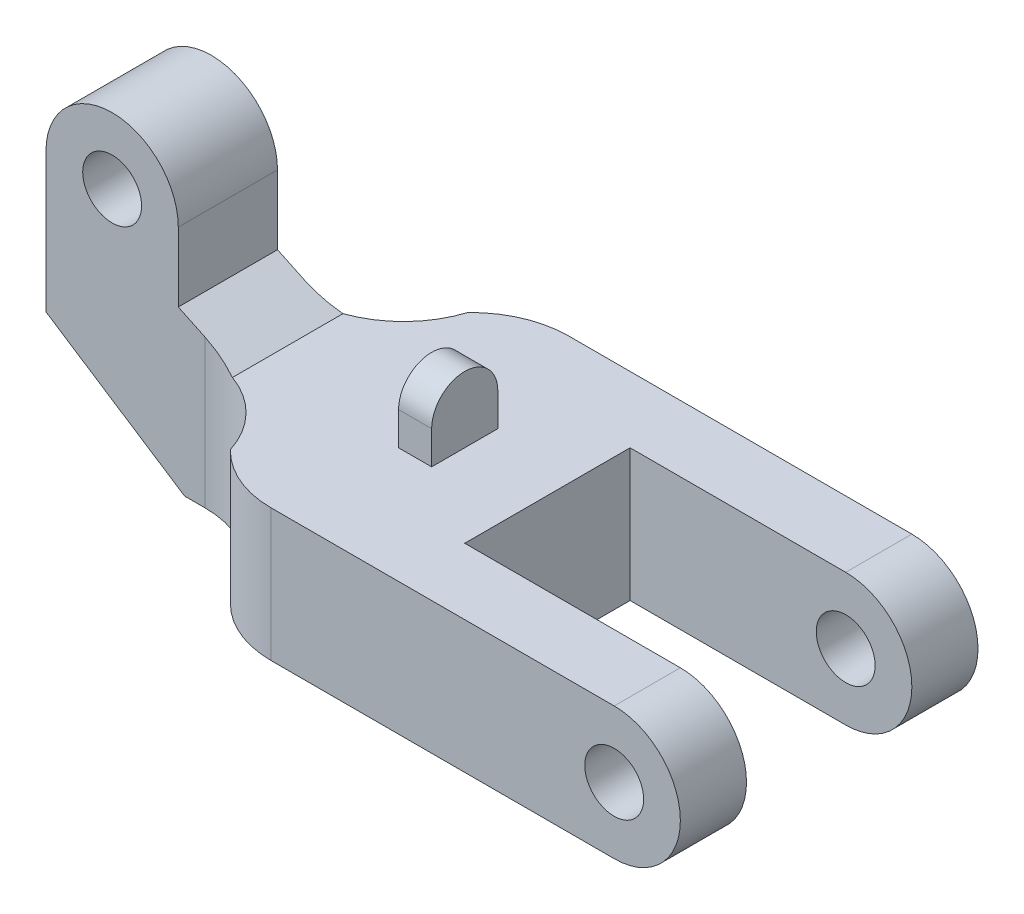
ISO-10303-21;
HEADER;
FILE_DESCRIPTION(('STEP AP214'),'2;1');
FILE_NAME('part.step','',(''),(''),'','','');
FILE_SCHEMA(('AUTOMOTIVE_DESIGN { 1 0 10303 214 1 1 1 1 }'));
ENDSEC;
DATA;
#1=APPLICATION_CONTEXT('core data for automotive mechanical design processes');
#2=APPLICATION_PROTOCOL_DEFINITION('international standard','automotive_design',2000,#1);
#3=PRODUCT_CONTEXT('',#1,'mechanical');
#4=PRODUCT('Part','Part','',(#3));
#5=PRODUCT_RELATED_PRODUCT_CATEGORY('part','',(#4));
#6=PRODUCT_DEFINITION_FORMATION('','',#4);
#7=PRODUCT_DEFINITION_CONTEXT('part definition',#1,'design');
#8=PRODUCT_DEFINITION('design','',#6,#7);
#9=PRODUCT_DEFINITION_SHAPE('','',#8);
#10=(LENGTH_UNIT() NAMED_UNIT(*) SI_UNIT(.MILLI.,.METRE.));
#11=(NAMED_UNIT(*) PLANE_ANGLE_UNIT() SI_UNIT($,.RADIAN.));
#12=(NAMED_UNIT(*) SI_UNIT($,.STERADIAN.) SOLID_ANGLE_UNIT());
#13=UNCERTAINTY_MEASURE_WITH_UNIT(LENGTH_MEASURE(1.E-05),#10,'distance_accuracy_value','');
#14=(GEOMETRIC_REPRESENTATION_CONTEXT(3) GLOBAL_UNCERTAINTY_ASSIGNED_CONTEXT((#13)) GLOBAL_UNIT_ASSIGNED_CONTEXT((#10,
#11,#12)) REPRESENTATION_CONTEXT('',''));
#15=CARTESIAN_POINT('',(0.,0.,0.));
#16=DIRECTION('',(0.,0.,1.));
#17=DIRECTION('',(1.,0.,0.));
#18=AXIS2_PLACEMENT_3D('',#15,#16,#17);
#19=CARTESIAN_POINT('',(0.,-5.72719849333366,9.));
#20=DIRECTION('',(0.,-1.,0.));
#21=DIRECTION('',(1.,0.,0.));
#22=AXIS2_PLACEMENT_3D('',#19,#20,#21);
#23=PLANE('',#22);
#24=DIRECTION('',(0.,0.,1.));
#25=VECTOR('',#24,1.);
#26=CARTESIAN_POINT('',(-26.8579530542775,-5.72719849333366,5.5));
#27=LINE('',#26,#25);
#28=CARTESIAN_POINT('',(-26.8579530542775,-5.72719849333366,3.5));
#29=VERTEX_POINT('',#28);
#30=CARTESIAN_POINT('',(-26.8579530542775,-5.72719849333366,5.5));
#31=VERTEX_POINT('',#30);
#32=EDGE_CURVE('E283',#29,#31,#27,.T.);
#33=ORIENTED_EDGE('',*,*,#32,.F.);
#34=DIRECTION('',(-1.,0.,0.));
#35=VECTOR('',#34,1.);
#36=CARTESIAN_POINT('',(-25.8579530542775,-5.72719849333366,3.5));
#37=LINE('',#36,#35);
#38=CARTESIAN_POINT('',(-25.8579530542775,-5.72719849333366,3.5));
#39=VERTEX_POINT('',#38);
#40=EDGE_CURVE('E292',#39,#29,#37,.T.);
#41=ORIENTED_EDGE('',*,*,#40,.F.);
#42=DIRECTION('',(0.,0.,-1.));
#43=VECTOR('',#42,1.);
#44=CARTESIAN_POINT('',(-25.8579530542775,-5.72719849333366,5.5));
#45=LINE('',#44,#43);
#46=CARTESIAN_POINT('',(-25.8579530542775,-5.72719849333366,5.5));
#47=VERTEX_POINT('',#46);
#48=EDGE_CURVE('E289',#47,#39,#45,.T.);
#49=ORIENTED_EDGE('',*,*,#48,.F.);
#50=DIRECTION('',(1.,0.,0.));
#51=VECTOR('',#50,1.);
#52=CARTESIAN_POINT('',(-25.8579530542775,-5.72719849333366,5.5));
#53=LINE('',#52,#51);
#54=EDGE_CURVE('E286',#31,#47,#53,.T.);
#55=ORIENTED_EDGE('',*,*,#54,.F.);
#56=EDGE_LOOP('',(#33,#41,#49,#55));
#57=FACE_BOUND('',#56,.T.);
#58=DIRECTION('',(-1.,0.,0.));
#59=VECTOR('',#58,1.);
#60=CARTESIAN_POINT('',(0.,-5.72719849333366,0.));
#61=LINE('',#60,#59);
#62=CARTESIAN_POINT('',(-16.8379530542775,-5.72719849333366,0.));
#63=VERTEX_POINT('',#62);
#64=CARTESIAN_POINT('',(-27.2112058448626,-5.72719849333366,0.));
#65=VERTEX_POINT('',#64);
#66=EDGE_CURVE('E194',#63,#65,#61,.T.);
#67=ORIENTED_EDGE('',*,*,#66,.T.);
#68=CARTESIAN_POINT('',(-27.2112058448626,-5.72719849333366,2.97638622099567));
#69=DIRECTION('',(0.,-1.,0.));
#70=DIRECTION('',(-1.,0.,0.));
#71=AXIS2_PLACEMENT_3D('',#68,#69,#70);
#72=CIRCLE('',#71,2.97638622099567);
#73=CARTESIAN_POINT('',(-29.3521440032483,-5.72719849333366,0.908716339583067));
#74=VERTEX_POINT('',#73);
#75=EDGE_CURVE('E182',#74,#65,#72,.T.);
#76=ORIENTED_EDGE('',*,*,#75,.F.);
#77=CARTESIAN_POINT('',(-32.2112058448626,-5.72719849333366,0.));
#78=DIRECTION('',(0.,-1.,0.));
#79=DIRECTION('',(1.,0.,0.));
#80=AXIS2_PLACEMENT_3D('',#77,#78,#79);
#81=CIRCLE('',#80,3.);
#82=CARTESIAN_POINT('',(-31.2112058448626,-5.72719849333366,2.82842712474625));
#83=VERTEX_POINT('',#82);
#84=EDGE_CURVE('E190',#74,#83,#81,.T.);
#85=ORIENTED_EDGE('',*,*,#84,.T.);
#86=DIRECTION('',(0.,0.,-1.));
#87=VECTOR('',#86,1.);
#88=CARTESIAN_POINT('',(-31.2112058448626,-5.72719849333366,9.));
#89=LINE('',#88,#87);
#90=CARTESIAN_POINT('',(-31.2112058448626,-5.72719849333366,6.17157287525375));
#91=VERTEX_POINT('',#90);
#92=EDGE_CURVE('E225',#91,#83,#89,.T.);
#93=ORIENTED_EDGE('',*,*,#92,.F.);
#94=CARTESIAN_POINT('',(-32.2112058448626,-5.72719849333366,9.));
#95=DIRECTION('',(0.,-1.,0.));
#96=DIRECTION('',(1.,0.,0.));
#97=AXIS2_PLACEMENT_3D('',#94,#95,#96);
#98=CIRCLE('',#97,3.);
#99=CARTESIAN_POINT('',(-29.3521440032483,-5.72719849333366,8.09128366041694));
#100=VERTEX_POINT('',#99);
#101=EDGE_CURVE('E214',#91,#100,#98,.T.);
#102=ORIENTED_EDGE('',*,*,#101,.T.);
#103=CARTESIAN_POINT('',(-27.2112058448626,-5.72719849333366,6.02361377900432));
#104=DIRECTION('',(0.,-1.,0.));
#105=DIRECTION('',(1.,0.,0.));
#106=AXIS2_PLACEMENT_3D('',#103,#104,#105);
#107=CIRCLE('',#106,2.97638622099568);
#108=CARTESIAN_POINT('',(-27.2112058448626,-5.72719849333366,9.));
#109=VERTEX_POINT('',#108);
#110=EDGE_CURVE('E57',#109,#100,#107,.T.);
#111=ORIENTED_EDGE('',*,*,#110,.F.);
#112=DIRECTION('',(-1.,0.,0.));
#113=VECTOR('',#112,1.);
#114=CARTESIAN_POINT('',(0.,-5.72719849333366,9.));
#115=LINE('',#114,#113);
#116=CARTESIAN_POINT('',(-16.8379530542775,-5.72719849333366,9.));
#117=VERTEX_POINT('',#116);
#118=EDGE_CURVE('E348',#117,#109,#115,.T.);
#119=ORIENTED_EDGE('',*,*,#118,.F.);
#120=DIRECTION('',(0.,0.,1.));
#121=VECTOR('',#120,1.);
#122=CARTESIAN_POINT('',(-16.8379530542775,-5.72719849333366,-1.));
#123=LINE('',#122,#121);
#124=CARTESIAN_POINT('',(-16.8379530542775,-5.72719849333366,7.));
#125=VERTEX_POINT('',#124);
#126=EDGE_CURVE('E307',#125,#117,#123,.T.);
#127=ORIENTED_EDGE('',*,*,#126,.F.);
#128=DIRECTION('',(1.,0.,0.));
#129=VECTOR('',#128,1.);
#130=CARTESIAN_POINT('',(-14.0579530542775,-5.72719849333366,7.));
#131=LINE('',#130,#129);
#132=CARTESIAN_POINT('',(-23.3579530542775,-5.72719849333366,7.));
#133=VERTEX_POINT('',#132);
#134=EDGE_CURVE('E321',#133,#125,#131,.T.);
#135=ORIENTED_EDGE('',*,*,#134,.F.);
#136=DIRECTION('',(0.,0.,1.));
#137=VECTOR('',#136,1.);
#138=CARTESIAN_POINT('',(-23.3579530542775,-5.72719849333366,2.));
#139=LINE('',#138,#137);
#140=CARTESIAN_POINT('',(-23.3579530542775,-5.72719849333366,2.));
#141=VERTEX_POINT('',#140);
#142=EDGE_CURVE('E319',#141,#133,#139,.T.);
#143=ORIENTED_EDGE('',*,*,#142,.F.);
#144=DIRECTION('',(-1.,0.,0.));
#145=VECTOR('',#144,1.);
#146=CARTESIAN_POINT('',(-14.0579530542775,-5.72719849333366,2.));
#147=LINE('',#146,#145);
#148=CARTESIAN_POINT('',(-16.8379530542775,-5.72719849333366,2.));
#149=VERTEX_POINT('',#148);
#150=EDGE_CURVE('E324',#149,#141,#147,.T.);
#151=ORIENTED_EDGE('',*,*,#150,.F.);
#152=EDGE_CURVE('E309',#63,#149,#123,.T.);
#153=ORIENTED_EDGE('',*,*,#152,.F.);
#154=EDGE_LOOP('',(#67,#76,#85,#93,#102,#111,#119,#127,#135,#143,#151,#153));
#155=FACE_BOUND('',#154,.T.);
#156=ADVANCED_FACE('F35',(#57,#155),#23,.F.);
#157=CARTESIAN_POINT('',(0.,-9.72719849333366,9.));
#158=DIRECTION('',(0.,1.,0.));
#159=DIRECTION('',(0.,0.,1.));
#160=AXIS2_PLACEMENT_3D('',#157,#158,#159);
#161=PLANE('',#160);
#162=CARTESIAN_POINT('',(-32.2112058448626,-9.72719849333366,0.));
#163=DIRECTION('',(0.,1.,0.));
#164=DIRECTION('',(0.,0.,1.));
#165=AXIS2_PLACEMENT_3D('',#162,#163,#164);
#166=CIRCLE('',#165,3.);
#167=CARTESIAN_POINT('',(-32.2112058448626,-9.72719849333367,3.));
#168=VERTEX_POINT('',#167);
#169=CARTESIAN_POINT('',(-29.3521440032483,-9.72719849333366,0.908716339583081));
#170=VERTEX_POINT('',#169);
#171=EDGE_CURVE('E203',#168,#170,#166,.T.);
#172=ORIENTED_EDGE('',*,*,#171,.T.);
#173=CARTESIAN_POINT('',(-27.2112058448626,-9.72719849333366,2.97638622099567));
#174=DIRECTION('',(0.,1.,0.));
#175=DIRECTION('',(0.,0.,1.));
#176=AXIS2_PLACEMENT_3D('',#173,#174,#175);
#177=CIRCLE('',#176,2.97638622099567);
#178=CARTESIAN_POINT('',(-27.2112058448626,-9.72719849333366,0.));
#179=VERTEX_POINT('',#178);
#180=EDGE_CURVE('E50',#170,#179,#177,.F.);
#181=ORIENTED_EDGE('',*,*,#180,.T.);
#182=DIRECTION('',(1.,0.,0.));
#183=VECTOR('',#182,1.);
#184=CARTESIAN_POINT('',(0.,-9.72719849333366,0.));
#185=LINE('',#184,#183);
#186=CARTESIAN_POINT('',(-16.8379530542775,-9.72719849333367,0.));
#187=VERTEX_POINT('',#186);
#188=EDGE_CURVE('E352',#179,#187,#185,.T.);
#189=ORIENTED_EDGE('',*,*,#188,.T.);
#190=DIRECTION('',(0.,0.,1.));
#191=VECTOR('',#190,1.);
#192=CARTESIAN_POINT('',(-16.8379530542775,-9.72719849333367,-1.));
#193=LINE('',#192,#191);
#194=CARTESIAN_POINT('',(-16.8379530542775,-9.72719849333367,2.));
#195=VERTEX_POINT('',#194);
#196=EDGE_CURVE('E310',#187,#195,#193,.T.);
#197=ORIENTED_EDGE('',*,*,#196,.T.);
#198=DIRECTION('',(-1.,0.,0.));
#199=VECTOR('',#198,1.);
#200=CARTESIAN_POINT('',(0.,-9.72719849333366,1.99999999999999));
#201=LINE('',#200,#199);
#202=CARTESIAN_POINT('',(-23.3579530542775,-9.72719849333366,2.));
#203=VERTEX_POINT('',#202);
#204=EDGE_CURVE('E337',#195,#203,#201,.T.);
#205=ORIENTED_EDGE('',*,*,#204,.T.);
#206=DIRECTION('',(0.,0.,1.));
#207=VECTOR('',#206,1.);
#208=CARTESIAN_POINT('',(-23.3579530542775,-9.72719849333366,9.));
#209=LINE('',#208,#207);
#210=CARTESIAN_POINT('',(-23.3579530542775,-9.72719849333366,7.));
#211=VERTEX_POINT('',#210);
#212=EDGE_CURVE('E339',#203,#211,#209,.T.);
#213=ORIENTED_EDGE('',*,*,#212,.T.);
#214=DIRECTION('',(1.,0.,0.));
#215=VECTOR('',#214,1.);
#216=CARTESIAN_POINT('',(0.,-9.72719849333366,7.));
#217=LINE('',#216,#215);
#218=CARTESIAN_POINT('',(-16.8379530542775,-9.72719849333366,7.));
#219=VERTEX_POINT('',#218);
#220=EDGE_CURVE('E333',#211,#219,#217,.T.);
#221=ORIENTED_EDGE('',*,*,#220,.T.);
#222=CARTESIAN_POINT('',(-16.8379530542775,-9.72719849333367,9.));
#223=VERTEX_POINT('',#222);
#224=EDGE_CURVE('E306',#219,#223,#193,.T.);
#225=ORIENTED_EDGE('',*,*,#224,.T.);
#226=DIRECTION('',(1.,0.,0.));
#227=VECTOR('',#226,1.);
#228=CARTESIAN_POINT('',(0.,-9.72719849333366,9.));
#229=LINE('',#228,#227);
#230=CARTESIAN_POINT('',(-27.2112058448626,-9.72719849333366,9.));
#231=VERTEX_POINT('',#230);
#232=EDGE_CURVE('E346',#231,#223,#229,.T.);
#233=ORIENTED_EDGE('',*,*,#232,.F.);
#234=CARTESIAN_POINT('',(-27.2112058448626,-9.72719849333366,6.02361377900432));
#235=DIRECTION('',(0.,1.,0.));
#236=DIRECTION('',(0.,0.,1.));
#237=AXIS2_PLACEMENT_3D('',#234,#235,#236);
#238=CIRCLE('',#237,2.97638622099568);
#239=CARTESIAN_POINT('',(-29.3521440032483,-9.72719849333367,8.09128366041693));
#240=VERTEX_POINT('',#239);
#241=EDGE_CURVE('E395',#231,#240,#238,.F.);
#242=ORIENTED_EDGE('',*,*,#241,.T.);
#243=CARTESIAN_POINT('',(-32.2112058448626,-9.72719849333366,9.));
#244=DIRECTION('',(0.,1.,0.));
#245=DIRECTION('',(0.,0.,1.));
#246=AXIS2_PLACEMENT_3D('',#243,#244,#245);
#247=CIRCLE('',#246,3.);
#248=CARTESIAN_POINT('',(-32.2112058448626,-9.72719849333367,6.));
#249=VERTEX_POINT('',#248);
#250=EDGE_CURVE('E217',#240,#249,#247,.T.);
#251=ORIENTED_EDGE('',*,*,#250,.T.);
#252=DIRECTION('',(1.,0.,0.));
#253=VECTOR('',#252,1.);
#254=CARTESIAN_POINT('',(-32.8279530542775,-9.72719849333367,6.));
#255=LINE('',#254,#253);
#256=CARTESIAN_POINT('',(-32.8279530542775,-9.72719849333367,6.));
#257=VERTEX_POINT('',#256);
#258=EDGE_CURVE('E239',#257,#249,#255,.T.);
#259=ORIENTED_EDGE('',*,*,#258,.F.);
#260=DIRECTION('',(0.,0.,-1.));
#261=VECTOR('',#260,1.);
#262=CARTESIAN_POINT('',(-32.8279530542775,-9.72719849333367,9.));
#263=LINE('',#262,#261);
#264=CARTESIAN_POINT('',(-32.8279530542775,-9.72719849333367,3.));
#265=VERTEX_POINT('',#264);
#266=EDGE_CURVE('E227',#257,#265,#263,.T.);
#267=ORIENTED_EDGE('',*,*,#266,.T.);
#268=DIRECTION('',(-1.,0.,0.));
#269=VECTOR('',#268,1.);
#270=CARTESIAN_POINT('',(-32.8279530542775,-9.72719849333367,3.));
#271=LINE('',#270,#269);
#272=EDGE_CURVE('E256',#168,#265,#271,.T.);
#273=ORIENTED_EDGE('',*,*,#272,.F.);
#274=EDGE_LOOP('',(#172,#181,#189,#197,#205,#213,#221,#225,#233,#242,#251,#259,#267,#273));
#275=FACE_BOUND('',#274,.T.);
#276=ADVANCED_FACE('F373',(#275),#161,.F.);
#277=CARTESIAN_POINT('',(0.,0.,0.));
#278=DIRECTION('',(0.,0.,1.));
#279=DIRECTION('',(1.,0.,0.));
#280=AXIS2_PLACEMENT_3D('',#277,#278,#279);
#281=PLANE('',#280);
#282=CARTESIAN_POINT('',(-16.8379530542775,-7.72719849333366,0.));
#283=DIRECTION('',(0.,0.,1.));
#284=DIRECTION('',(1.,0.,0.));
#285=AXIS2_PLACEMENT_3D('',#282,#283,#284);
#286=CIRCLE('',#285,0.89);
#287=CARTESIAN_POINT('',(-15.9479530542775,-7.72719849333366,0.));
#288=VERTEX_POINT('',#287);
#289=EDGE_CURVE('E342',#288,#288,#286,.T.);
#290=ORIENTED_EDGE('',*,*,#289,.T.);
#291=EDGE_LOOP('',(#290));
#292=FACE_BOUND('',#291,.T.);
#293=DIRECTION('',(0.,1.,0.));
#294=VECTOR('',#293,1.);
#295=CARTESIAN_POINT('',(-27.2112058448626,-10.7271984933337,0.));
#296=LINE('',#295,#294);
#297=EDGE_CURVE('E195',#179,#65,#296,.T.);
#298=ORIENTED_EDGE('',*,*,#297,.T.);
#299=ORIENTED_EDGE('',*,*,#66,.F.);
#300=CARTESIAN_POINT('',(-16.8379530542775,-7.72719849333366,0.));
#301=DIRECTION('',(0.,0.,1.));
#302=DIRECTION('',(1.,0.,0.));
#303=AXIS2_PLACEMENT_3D('',#300,#301,#302);
#304=CIRCLE('',#303,2.);
#305=EDGE_CURVE('E316',#63,#187,#304,.F.);
#306=ORIENTED_EDGE('',*,*,#305,.T.);
#307=ORIENTED_EDGE('',*,*,#188,.F.);
#308=EDGE_LOOP('',(#298,#299,#306,#307));
#309=FACE_BOUND('',#308,.T.);
#310=ADVANCED_FACE('F405',(#292,#309),#281,.F.);
#311=CARTESIAN_POINT('',(0.,0.,9.));
#312=DIRECTION('',(0.,0.,1.));
#313=DIRECTION('',(1.,0.,0.));
#314=AXIS2_PLACEMENT_3D('',#311,#312,#313);
#315=PLANE('',#314);
#316=CARTESIAN_POINT('',(-16.8379530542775,-7.72719849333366,9.));
#317=DIRECTION('',(0.,0.,1.));
#318=DIRECTION('',(1.,0.,0.));
#319=AXIS2_PLACEMENT_3D('',#316,#317,#318);
#320=CIRCLE('',#319,0.89);
#321=CARTESIAN_POINT('',(-15.9479530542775,-7.72719849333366,9.));
#322=VERTEX_POINT('',#321);
#323=EDGE_CURVE('E343',#322,#322,#320,.T.);
#324=ORIENTED_EDGE('',*,*,#323,.F.);
#325=EDGE_LOOP('',(#324));
#326=FACE_BOUND('',#325,.T.);
#327=ORIENTED_EDGE('',*,*,#118,.T.);
#328=DIRECTION('',(0.,1.,0.));
#329=VECTOR('',#328,1.);
#330=CARTESIAN_POINT('',(-27.2112058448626,-10.7271984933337,9.));
#331=LINE('',#330,#329);
#332=EDGE_CURVE('E399',#231,#109,#331,.T.);
#333=ORIENTED_EDGE('',*,*,#332,.F.);
#334=ORIENTED_EDGE('',*,*,#232,.T.);
#335=CARTESIAN_POINT('',(-16.8379530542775,-7.72719849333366,9.));
#336=DIRECTION('',(0.,0.,-1.));
#337=DIRECTION('',(1.,0.,0.));
#338=AXIS2_PLACEMENT_3D('',#335,#336,#337);
#339=CIRCLE('',#338,2.);
#340=EDGE_CURVE('E303',#117,#223,#339,.T.);
#341=ORIENTED_EDGE('',*,*,#340,.F.);
#342=EDGE_LOOP('',(#327,#333,#334,#341));
#343=FACE_BOUND('',#342,.T.);
#344=ADVANCED_FACE('F429',(#326,#343),#315,.T.);
#345=CARTESIAN_POINT('',(-33.018703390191,0.,9.));
#346=DIRECTION('',(1.,0.,0.));
#347=DIRECTION('',(0.,0.,-1.));
#348=AXIS2_PLACEMENT_3D('',#345,#346,#347);
#349=PLANE('',#348);
#350=DIRECTION('',(0.,0.,-1.));
#351=VECTOR('',#350,1.);
#352=CARTESIAN_POINT('',(-33.018703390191,-2.78,9.));
#353=LINE('',#352,#351);
#354=CARTESIAN_POINT('',(-33.018703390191,-2.78,6.));
#355=VERTEX_POINT('',#354);
#356=CARTESIAN_POINT('',(-33.018703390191,-2.78,3.));
#357=VERTEX_POINT('',#356);
#358=EDGE_CURVE('E361',#355,#357,#353,.T.);
#359=ORIENTED_EDGE('',*,*,#358,.F.);
#360=DIRECTION('',(0.,1.,0.));
#361=VECTOR('',#360,1.);
#362=CARTESIAN_POINT('',(-33.018703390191,-4.87107197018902,6.));
#363=LINE('',#362,#361);
#364=CARTESIAN_POINT('',(-33.018703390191,-4.87107197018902,6.));
#365=VERTEX_POINT('',#364);
#366=EDGE_CURVE('E392',#365,#355,#363,.T.);
#367=ORIENTED_EDGE('',*,*,#366,.F.);
#368=DIRECTION('',(0.,0.,-1.));
#369=VECTOR('',#368,1.);
#370=CARTESIAN_POINT('',(-33.018703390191,-4.87107197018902,9.));
#371=LINE('',#370,#369);
#372=CARTESIAN_POINT('',(-33.018703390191,-4.87107197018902,3.));
#373=VERTEX_POINT('',#372);
#374=EDGE_CURVE('E228',#365,#373,#371,.T.);
#375=ORIENTED_EDGE('',*,*,#374,.T.);
#376=DIRECTION('',(0.,-1.,0.));
#377=VECTOR('',#376,1.);
#378=CARTESIAN_POINT('',(-33.018703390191,-4.87107197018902,3.));
#379=LINE('',#378,#377);
#380=EDGE_CURVE('E267',#357,#373,#379,.T.);
#381=ORIENTED_EDGE('',*,*,#380,.F.);
#382=EDGE_LOOP('',(#359,#367,#375,#381));
#383=FACE_BOUND('',#382,.T.);
#384=ADVANCED_FACE('F391',(#383),#349,.T.);
#385=CARTESIAN_POINT('',(-35.018703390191,-2.78,9.));
#386=DIRECTION('',(0.,0.,-1.));
#387=DIRECTION('',(-1.,0.,0.));
#388=AXIS2_PLACEMENT_3D('',#385,#386,#387);
#389=CYLINDRICAL_SURFACE('',#388,2.);
#390=CARTESIAN_POINT('',(-35.018703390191,-2.78,6.));
#391=DIRECTION('',(0.,0.,1.));
#392=DIRECTION('',(1.,0.,0.));
#393=AXIS2_PLACEMENT_3D('',#390,#391,#392);
#394=CIRCLE('',#393,2.);
#395=CARTESIAN_POINT('',(-37.018703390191,-2.78,6.));
#396=VERTEX_POINT('',#395);
#397=EDGE_CURVE('E387',#355,#396,#394,.T.);
#398=ORIENTED_EDGE('',*,*,#397,.F.);
#399=ORIENTED_EDGE('',*,*,#358,.T.);
#400=CARTESIAN_POINT('',(-35.018703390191,-2.78,3.));
#401=DIRECTION('',(0.,0.,-1.));
#402=DIRECTION('',(1.,0.,0.));
#403=AXIS2_PLACEMENT_3D('',#400,#401,#402);
#404=CIRCLE('',#403,2.);
#405=CARTESIAN_POINT('',(-37.018703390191,-2.78,3.));
#406=VERTEX_POINT('',#405);
#407=EDGE_CURVE('E264',#406,#357,#404,.T.);
#408=ORIENTED_EDGE('',*,*,#407,.F.);
#409=DIRECTION('',(0.,0.,-1.));
#410=VECTOR('',#409,1.);
#411=CARTESIAN_POINT('',(-37.018703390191,-2.78,9.));
#412=LINE('',#411,#410);
#413=EDGE_CURVE('E359',#396,#406,#412,.T.);
#414=ORIENTED_EDGE('',*,*,#413,.F.);
#415=EDGE_LOOP('',(#398,#399,#408,#414));
#416=FACE_BOUND('',#415,.T.);
#417=ADVANCED_FACE('F386',(#416),#389,.T.);
#418=CARTESIAN_POINT('',(-37.018703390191,0.,9.));
#419=DIRECTION('',(1.,0.,0.));
#420=DIRECTION('',(0.,0.,-1.));
#421=AXIS2_PLACEMENT_3D('',#418,#419,#420);
#422=PLANE('',#421);
#423=DIRECTION('',(0.,-1.,0.));
#424=VECTOR('',#423,1.);
#425=CARTESIAN_POINT('',(-37.018703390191,-2.78,6.));
#426=LINE('',#425,#424);
#427=CARTESIAN_POINT('',(-37.018703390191,-7.,6.));
#428=VERTEX_POINT('',#427);
#429=EDGE_CURVE('E250',#396,#428,#426,.T.);
#430=ORIENTED_EDGE('',*,*,#429,.F.);
#431=ORIENTED_EDGE('',*,*,#413,.T.);
#432=DIRECTION('',(0.,1.,0.));
#433=VECTOR('',#432,1.);
#434=CARTESIAN_POINT('',(-37.018703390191,-2.78,3.));
#435=LINE('',#434,#433);
#436=CARTESIAN_POINT('',(-37.018703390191,-7.,3.));
#437=VERTEX_POINT('',#436);
#438=EDGE_CURVE('E261',#437,#406,#435,.T.);
#439=ORIENTED_EDGE('',*,*,#438,.F.);
#440=DIRECTION('',(0.,0.,-1.));
#441=VECTOR('',#440,1.);
#442=CARTESIAN_POINT('',(-37.018703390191,-7.,9.));
#443=LINE('',#442,#441);
#444=EDGE_CURVE('E357',#428,#437,#443,.T.);
#445=ORIENTED_EDGE('',*,*,#444,.F.);
#446=EDGE_LOOP('',(#430,#431,#439,#445));
#447=FACE_BOUND('',#446,.T.);
#448=ADVANCED_FACE('F382',(#447),#422,.F.);
#449=CARTESIAN_POINT('',(-14.2133517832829,-21.8409510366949,9.));
#450=DIRECTION('',(0.545439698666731,0.838150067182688,0.));
#451=DIRECTION('',(-0.838150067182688,0.545439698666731,0.));
#452=AXIS2_PLACEMENT_3D('',#449,#450,#451);
#453=PLANE('',#452);
#454=DIRECTION('',(0.838150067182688,-0.545439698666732,0.));
#455=VECTOR('',#454,1.);
#456=CARTESIAN_POINT('',(-37.018703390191,-7.,6.));
#457=LINE('',#456,#455);
#458=EDGE_CURVE('E241',#428,#257,#457,.T.);
#459=ORIENTED_EDGE('',*,*,#458,.F.);
#460=ORIENTED_EDGE('',*,*,#444,.T.);
#461=DIRECTION('',(-0.838150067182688,0.545439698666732,0.));
#462=VECTOR('',#461,1.);
#463=CARTESIAN_POINT('',(-37.018703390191,-7.,3.));
#464=LINE('',#463,#462);
#465=EDGE_CURVE('E258',#265,#437,#464,.T.);
#466=ORIENTED_EDGE('',*,*,#465,.F.);
#467=ORIENTED_EDGE('',*,*,#266,.F.);
#468=EDGE_LOOP('',(#459,#460,#466,#467));
#469=FACE_BOUND('',#468,.T.);
#470=ADVANCED_FACE('F376',(#469),#453,.F.);
#471=CARTESIAN_POINT('',(-35.018703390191,-2.78,9.));
#472=DIRECTION('',(0.,0.,-1.));
#473=DIRECTION('',(-1.,0.,0.));
#474=AXIS2_PLACEMENT_3D('',#471,#472,#473);
#475=CYLINDRICAL_SURFACE('',#474,0.89);
#476=CARTESIAN_POINT('',(-35.018703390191,-2.78,3.));
#477=DIRECTION('',(0.,0.,-1.));
#478=DIRECTION('',(-1.,0.,0.));
#479=AXIS2_PLACEMENT_3D('',#476,#477,#478);
#480=CIRCLE('',#479,0.89);
#481=CARTESIAN_POINT('',(-35.908703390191,-2.78,3.));
#482=VERTEX_POINT('',#481);
#483=EDGE_CURVE('E248',#482,#482,#480,.T.);
#484=ORIENTED_EDGE('',*,*,#483,.T.);
#485=EDGE_LOOP('',(#484));
#486=FACE_BOUND('',#485,.T.);
#487=CARTESIAN_POINT('',(-35.018703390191,-2.78,6.));
#488=DIRECTION('',(0.,0.,1.));
#489=DIRECTION('',(1.,0.,0.));
#490=AXIS2_PLACEMENT_3D('',#487,#488,#489);
#491=CIRCLE('',#490,0.89);
#492=CARTESIAN_POINT('',(-34.128703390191,-2.78,6.));
#493=VERTEX_POINT('',#492);
#494=EDGE_CURVE('E245',#493,#493,#491,.T.);
#495=ORIENTED_EDGE('',*,*,#494,.T.);
#496=EDGE_LOOP('',(#495));
#497=FACE_BOUND('',#496,.T.);
#498=ADVANCED_FACE('F453',(#486,#497),#475,.F.);
#499=CARTESIAN_POINT('',(-7.93471724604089,-16.7521757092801,9.));
#500=DIRECTION('',(0.428063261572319,0.903748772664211,0.));
#501=DIRECTION('',(-0.903748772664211,0.428063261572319,0.));
#502=AXIS2_PLACEMENT_3D('',#499,#500,#501);
#503=PLANE('',#502);
#504=ORIENTED_EDGE('',*,*,#374,.F.);
#505=DIRECTION('',(-0.903748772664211,0.428063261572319,0.));
#506=VECTOR('',#505,1.);
#507=CARTESIAN_POINT('',(-31.2112058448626,-5.72719849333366,6.));
#508=LINE('',#507,#506);
#509=CARTESIAN_POINT('',(-32.2112058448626,-5.25354555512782,6.));
#510=VERTEX_POINT('',#509);
#511=EDGE_CURVE('E233',#510,#365,#508,.T.);
#512=ORIENTED_EDGE('',*,*,#511,.F.);
#513=CARTESIAN_POINT('',(-32.2112058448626,-5.25354555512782,9.));
#514=DIRECTION('',(0.428063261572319,0.903748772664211,0.));
#515=DIRECTION('',(-0.903748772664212,0.428063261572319,0.));
#516=AXIS2_PLACEMENT_3D('',#513,#514,#515);
#517=ELLIPSE('',#516,3.31950658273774,3.);
#518=EDGE_CURVE('E211',#510,#91,#517,.F.);
#519=ORIENTED_EDGE('',*,*,#518,.T.);
#520=ORIENTED_EDGE('',*,*,#92,.T.);
#521=CARTESIAN_POINT('',(-32.2112058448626,-5.25354555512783,0.));
#522=DIRECTION('',(0.428063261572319,0.903748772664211,0.));
#523=DIRECTION('',(0.903748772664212,-0.428063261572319,0.));
#524=AXIS2_PLACEMENT_3D('',#521,#522,#523);
#525=ELLIPSE('',#524,3.31950658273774,3.);
#526=CARTESIAN_POINT('',(-32.2112058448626,-5.25354555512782,3.));
#527=VERTEX_POINT('',#526);
#528=EDGE_CURVE('E200',#83,#527,#525,.F.);
#529=ORIENTED_EDGE('',*,*,#528,.T.);
#530=DIRECTION('',(0.903748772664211,-0.428063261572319,0.));
#531=VECTOR('',#530,1.);
#532=CARTESIAN_POINT('',(-31.2112058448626,-5.72719849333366,3.));
#533=LINE('',#532,#531);
#534=EDGE_CURVE('E270',#373,#527,#533,.T.);
#535=ORIENTED_EDGE('',*,*,#534,.F.);
#536=EDGE_LOOP('',(#504,#512,#519,#520,#529,#535));
#537=FACE_BOUND('',#536,.T.);
#538=ADVANCED_FACE('F232',(#537),#503,.T.);
#539=CARTESIAN_POINT('',(-26.8579530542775,-3.72719849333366,5.5));
#540=DIRECTION('',(1.,0.,0.));
#541=DIRECTION('',(0.,1.,0.));
#542=AXIS2_PLACEMENT_3D('',#539,#540,#541);
#543=PLANE('',#542);
#544=CARTESIAN_POINT('',(-26.8579530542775,-4.72719849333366,4.5));
#545=DIRECTION('',(1.,0.,0.));
#546=DIRECTION('',(0.,1.,0.));
#547=AXIS2_PLACEMENT_3D('',#544,#545,#546);
#548=CIRCLE('',#547,1.);
#549=CARTESIAN_POINT('',(-26.8579530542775,-4.72719849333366,3.5));
#550=VERTEX_POINT('',#549);
#551=CARTESIAN_POINT('',(-26.8579530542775,-4.72719849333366,5.5));
#552=VERTEX_POINT('',#551);
#553=EDGE_CURVE('E280',#550,#552,#548,.T.);
#554=ORIENTED_EDGE('',*,*,#553,.F.);
#555=DIRECTION('',(0.,-1.,0.));
#556=VECTOR('',#555,1.);
#557=CARTESIAN_POINT('',(-26.8579530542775,-3.72719849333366,3.5));
#558=LINE('',#557,#556);
#559=EDGE_CURVE('E295',#550,#29,#558,.T.);
#560=ORIENTED_EDGE('',*,*,#559,.T.);
#561=ORIENTED_EDGE('',*,*,#32,.T.);
#562=DIRECTION('',(0.,-1.,0.));
#563=VECTOR('',#562,1.);
#564=CARTESIAN_POINT('',(-26.8579530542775,-3.72719849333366,5.5));
#565=LINE('',#564,#563);
#566=EDGE_CURVE('E301',#552,#31,#565,.T.);
#567=ORIENTED_EDGE('',*,*,#566,.F.);
#568=EDGE_LOOP('',(#554,#560,#561,#567));
#569=FACE_BOUND('',#568,.T.);
#570=ADVANCED_FACE('F491',(#569),#543,.F.);
#571=CARTESIAN_POINT('',(-25.8579530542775,-3.72719849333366,5.5));
#572=DIRECTION('',(-1.,0.,0.));
#573=DIRECTION('',(0.,-1.,0.));
#574=AXIS2_PLACEMENT_3D('',#571,#572,#573);
#575=PLANE('',#574);
#576=CARTESIAN_POINT('',(-25.8579530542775,-4.72719849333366,4.5));
#577=DIRECTION('',(-1.,0.,0.));
#578=DIRECTION('',(0.,-1.,0.));
#579=AXIS2_PLACEMENT_3D('',#576,#577,#578);
#580=CIRCLE('',#579,1.);
#581=CARTESIAN_POINT('',(-25.8579530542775,-4.72719849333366,3.5));
#582=VERTEX_POINT('',#581);
#583=CARTESIAN_POINT('',(-25.8579530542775,-4.72719849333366,5.5));
#584=VERTEX_POINT('',#583);
#585=EDGE_CURVE('E273',#582,#584,#580,.F.);
#586=ORIENTED_EDGE('',*,*,#585,.T.);
#587=DIRECTION('',(0.,-1.,0.));
#588=VECTOR('',#587,1.);
#589=CARTESIAN_POINT('',(-25.8579530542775,-3.72719849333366,5.5));
#590=LINE('',#589,#588);
#591=EDGE_CURVE('E299',#584,#47,#590,.T.);
#592=ORIENTED_EDGE('',*,*,#591,.T.);
#593=ORIENTED_EDGE('',*,*,#48,.T.);
#594=DIRECTION('',(0.,-1.,0.));
#595=VECTOR('',#594,1.);
#596=CARTESIAN_POINT('',(-25.8579530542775,-3.72719849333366,3.5));
#597=LINE('',#596,#595);
#598=EDGE_CURVE('E297',#582,#39,#597,.T.);
#599=ORIENTED_EDGE('',*,*,#598,.F.);
#600=EDGE_LOOP('',(#586,#592,#593,#599));
#601=FACE_BOUND('',#600,.T.);
#602=ADVANCED_FACE('F487',(#601),#575,.F.);
#603=CARTESIAN_POINT('',(-25.8579530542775,-3.72719849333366,3.5));
#604=DIRECTION('',(0.,0.,1.));
#605=DIRECTION('',(1.,0.,0.));
#606=AXIS2_PLACEMENT_3D('',#603,#604,#605);
#607=PLANE('',#606);
#608=DIRECTION('',(-1.,0.,0.));
#609=VECTOR('',#608,1.);
#610=CARTESIAN_POINT('',(17.3603083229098,-4.72719849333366,3.5));
#611=LINE('',#610,#609);
#612=EDGE_CURVE('E275',#582,#550,#611,.T.);
#613=ORIENTED_EDGE('',*,*,#612,.F.);
#614=ORIENTED_EDGE('',*,*,#598,.T.);
#615=ORIENTED_EDGE('',*,*,#40,.T.);
#616=ORIENTED_EDGE('',*,*,#559,.F.);
#617=EDGE_LOOP('',(#613,#614,#615,#616));
#618=FACE_BOUND('',#617,.T.);
#619=ADVANCED_FACE('F484',(#618),#607,.F.);
#620=CARTESIAN_POINT('',(-16.8379530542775,-7.72719849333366,9.));
#621=DIRECTION('',(0.,0.,-1.));
#622=DIRECTION('',(-1.,0.,0.));
#623=AXIS2_PLACEMENT_3D('',#620,#621,#622);
#624=CYLINDRICAL_SURFACE('',#623,0.89);
#625=CARTESIAN_POINT('',(-16.8379530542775,-7.72719849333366,2.));
#626=DIRECTION('',(0.,0.,-1.));
#627=DIRECTION('',(-1.,0.,0.));
#628=AXIS2_PLACEMENT_3D('',#625,#626,#627);
#629=CIRCLE('',#628,0.89);
#630=CARTESIAN_POINT('',(-17.7279530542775,-7.72719849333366,2.));
#631=VERTEX_POINT('',#630);
#632=EDGE_CURVE('E336',#631,#631,#629,.T.);
#633=ORIENTED_EDGE('',*,*,#632,.F.);
#634=EDGE_LOOP('',(#633));
#635=FACE_BOUND('',#634,.T.);
#636=ORIENTED_EDGE('',*,*,#289,.F.);
#637=EDGE_LOOP('',(#636));
#638=FACE_BOUND('',#637,.T.);
#639=ADVANCED_FACE('F463',(#635,#638),#624,.F.);
#640=CARTESIAN_POINT('',(-16.8379530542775,-7.72719849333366,7.));
#641=DIRECTION('',(0.,0.,1.));
#642=DIRECTION('',(1.,0.,0.));
#643=AXIS2_PLACEMENT_3D('',#640,#641,#642);
#644=CIRCLE('',#643,0.89);
#645=CARTESIAN_POINT('',(-15.9479530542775,-7.72719849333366,7.));
#646=VERTEX_POINT('',#645);
#647=EDGE_CURVE('E330',#646,#646,#644,.T.);
#648=ORIENTED_EDGE('',*,*,#647,.F.);
#649=EDGE_LOOP('',(#648));
#650=FACE_BOUND('',#649,.T.);
#651=ORIENTED_EDGE('',*,*,#323,.T.);
#652=EDGE_LOOP('',(#651));
#653=FACE_BOUND('',#652,.T.);
#654=ADVANCED_FACE('F460',(#650,#653),#624,.F.);
#655=CARTESIAN_POINT('',(-23.3579530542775,-14.7271984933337,2.));
#656=DIRECTION('',(-1.,0.,0.));
#657=DIRECTION('',(0.,-1.,0.));
#658=AXIS2_PLACEMENT_3D('',#655,#656,#657);
#659=PLANE('',#658);
#660=DIRECTION('',(0.,1.,0.));
#661=VECTOR('',#660,1.);
#662=CARTESIAN_POINT('',(-23.3579530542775,-14.7271984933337,2.));
#663=LINE('',#662,#661);
#664=EDGE_CURVE('E327',#203,#141,#663,.T.);
#665=ORIENTED_EDGE('',*,*,#664,.T.);
#666=ORIENTED_EDGE('',*,*,#142,.T.);
#667=DIRECTION('',(0.,1.,0.));
#668=VECTOR('',#667,1.);
#669=CARTESIAN_POINT('',(-23.3579530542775,-14.7271984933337,7.));
#670=LINE('',#669,#668);
#671=EDGE_CURVE('E326',#211,#133,#670,.T.);
#672=ORIENTED_EDGE('',*,*,#671,.F.);
#673=ORIENTED_EDGE('',*,*,#212,.F.);
#674=EDGE_LOOP('',(#665,#666,#672,#673));
#675=FACE_BOUND('',#674,.T.);
#676=ADVANCED_FACE('F420',(#675),#659,.F.);
#677=CARTESIAN_POINT('',(-14.0579530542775,-14.7271984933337,2.));
#678=DIRECTION('',(0.,0.,-1.));
#679=DIRECTION('',(-1.,0.,0.));
#680=AXIS2_PLACEMENT_3D('',#677,#678,#679);
#681=PLANE('',#680);
#682=ORIENTED_EDGE('',*,*,#632,.T.);
#683=EDGE_LOOP('',(#682));
#684=FACE_BOUND('',#683,.T.);
#685=ORIENTED_EDGE('',*,*,#204,.F.);
#686=CARTESIAN_POINT('',(-16.8379530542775,-7.72719849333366,2.));
#687=DIRECTION('',(0.,0.,-1.));
#688=DIRECTION('',(-1.,0.,0.));
#689=AXIS2_PLACEMENT_3D('',#686,#687,#688);
#690=CIRCLE('',#689,2.);
#691=EDGE_CURVE('E313',#195,#149,#690,.F.);
#692=ORIENTED_EDGE('',*,*,#691,.T.);
#693=ORIENTED_EDGE('',*,*,#150,.T.);
#694=ORIENTED_EDGE('',*,*,#664,.F.);
#695=EDGE_LOOP('',(#685,#692,#693,#694));
#696=FACE_BOUND('',#695,.T.);
#697=ADVANCED_FACE('F413',(#684,#696),#681,.F.);
#698=CARTESIAN_POINT('',(-14.0579530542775,-14.7271984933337,7.));
#699=DIRECTION('',(0.,0.,1.));
#700=DIRECTION('',(1.,0.,0.));
#701=AXIS2_PLACEMENT_3D('',#698,#699,#700);
#702=PLANE('',#701);
#703=ORIENTED_EDGE('',*,*,#647,.T.);
#704=EDGE_LOOP('',(#703));
#705=FACE_BOUND('',#704,.T.);
#706=ORIENTED_EDGE('',*,*,#134,.T.);
#707=CARTESIAN_POINT('',(-16.8379530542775,-7.72719849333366,7.));
#708=DIRECTION('',(0.,0.,1.));
#709=DIRECTION('',(1.,0.,0.));
#710=AXIS2_PLACEMENT_3D('',#707,#708,#709);
#711=CIRCLE('',#710,2.);
#712=EDGE_CURVE('E363',#125,#219,#711,.F.);
#713=ORIENTED_EDGE('',*,*,#712,.T.);
#714=ORIENTED_EDGE('',*,*,#220,.F.);
#715=ORIENTED_EDGE('',*,*,#671,.T.);
#716=EDGE_LOOP('',(#706,#713,#714,#715));
#717=FACE_BOUND('',#716,.T.);
#718=ADVANCED_FACE('F423',(#705,#717),#702,.F.);
#719=CARTESIAN_POINT('',(-16.8379530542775,-7.72719849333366,-1.));
#720=DIRECTION('',(0.,0.,1.));
#721=DIRECTION('',(1.,0.,0.));
#722=AXIS2_PLACEMENT_3D('',#719,#720,#721);
#723=CYLINDRICAL_SURFACE('',#722,2.);
#724=ORIENTED_EDGE('',*,*,#126,.T.);
#725=ORIENTED_EDGE('',*,*,#340,.T.);
#726=ORIENTED_EDGE('',*,*,#224,.F.);
#727=ORIENTED_EDGE('',*,*,#712,.F.);
#728=EDGE_LOOP('',(#724,#725,#726,#727));
#729=FACE_BOUND('',#728,.T.);
#730=ADVANCED_FACE('F426',(#729),#723,.T.);
#731=ORIENTED_EDGE('',*,*,#152,.T.);
#732=ORIENTED_EDGE('',*,*,#691,.F.);
#733=ORIENTED_EDGE('',*,*,#196,.F.);
#734=ORIENTED_EDGE('',*,*,#305,.F.);
#735=EDGE_LOOP('',(#731,#732,#733,#734));
#736=FACE_BOUND('',#735,.T.);
#737=ADVANCED_FACE('F410',(#736),#723,.T.);
#738=CARTESIAN_POINT('',(-25.8579530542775,-3.72719849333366,5.5));
#739=DIRECTION('',(0.,0.,-1.));
#740=DIRECTION('',(-1.,0.,0.));
#741=AXIS2_PLACEMENT_3D('',#738,#739,#740);
#742=PLANE('',#741);
#743=ORIENTED_EDGE('',*,*,#591,.F.);
#744=DIRECTION('',(-1.,0.,0.));
#745=VECTOR('',#744,1.);
#746=CARTESIAN_POINT('',(17.3603083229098,-4.72719849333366,5.5));
#747=LINE('',#746,#745);
#748=EDGE_CURVE('E278',#584,#552,#747,.T.);
#749=ORIENTED_EDGE('',*,*,#748,.T.);
#750=ORIENTED_EDGE('',*,*,#566,.T.);
#751=ORIENTED_EDGE('',*,*,#54,.T.);
#752=EDGE_LOOP('',(#743,#749,#750,#751));
#753=FACE_BOUND('',#752,.T.);
#754=ADVANCED_FACE('F482',(#753),#742,.F.);
#755=CARTESIAN_POINT('',(17.3603083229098,-4.72719849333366,4.5));
#756=DIRECTION('',(-1.,0.,0.));
#757=DIRECTION('',(0.,-1.,0.));
#758=AXIS2_PLACEMENT_3D('',#755,#756,#757);
#759=CYLINDRICAL_SURFACE('',#758,1.);
#760=ORIENTED_EDGE('',*,*,#748,.F.);
#761=ORIENTED_EDGE('',*,*,#585,.F.);
#762=ORIENTED_EDGE('',*,*,#612,.T.);
#763=ORIENTED_EDGE('',*,*,#553,.T.);
#764=EDGE_LOOP('',(#760,#761,#762,#763));
#765=FACE_BOUND('',#764,.T.);
#766=ADVANCED_FACE('F475',(#765),#759,.T.);
#767=CARTESIAN_POINT('',(-35.018703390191,-2.78,3.));
#768=DIRECTION('',(0.,0.,1.));
#769=DIRECTION('',(1.,0.,0.));
#770=AXIS2_PLACEMENT_3D('',#767,#768,#769);
#771=PLANE('',#770);
#772=ORIENTED_EDGE('',*,*,#483,.F.);
#773=EDGE_LOOP('',(#772));
#774=FACE_BOUND('',#773,.T.);
#775=ORIENTED_EDGE('',*,*,#534,.T.);
#776=DIRECTION('',(0.,1.,0.));
#777=VECTOR('',#776,1.);
#778=CARTESIAN_POINT('',(-32.2112058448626,-9.72719849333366,3.));
#779=LINE('',#778,#777);
#780=EDGE_CURVE('E206',#527,#168,#779,.F.);
#781=ORIENTED_EDGE('',*,*,#780,.T.);
#782=ORIENTED_EDGE('',*,*,#272,.T.);
#783=ORIENTED_EDGE('',*,*,#465,.T.);
#784=ORIENTED_EDGE('',*,*,#438,.T.);
#785=ORIENTED_EDGE('',*,*,#407,.T.);
#786=ORIENTED_EDGE('',*,*,#380,.T.);
#787=EDGE_LOOP('',(#775,#781,#782,#783,#784,#785,#786));
#788=FACE_BOUND('',#787,.T.);
#789=ADVANCED_FACE('F371',(#774,#788),#771,.F.);
#790=CARTESIAN_POINT('',(-35.018703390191,-2.78,6.));
#791=DIRECTION('',(0.,0.,1.));
#792=DIRECTION('',(1.,0.,0.));
#793=AXIS2_PLACEMENT_3D('',#790,#791,#792);
#794=PLANE('',#793);
#795=ORIENTED_EDGE('',*,*,#494,.F.);
#796=EDGE_LOOP('',(#795));
#797=FACE_BOUND('',#796,.T.);
#798=ORIENTED_EDGE('',*,*,#258,.T.);
#799=DIRECTION('',(0.,1.,0.));
#800=VECTOR('',#799,1.);
#801=CARTESIAN_POINT('',(-32.2112058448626,-2.78,6.));
#802=LINE('',#801,#800);
#803=EDGE_CURVE('E201',#249,#510,#802,.T.);
#804=ORIENTED_EDGE('',*,*,#803,.T.);
#805=ORIENTED_EDGE('',*,*,#511,.T.);
#806=ORIENTED_EDGE('',*,*,#366,.T.);
#807=ORIENTED_EDGE('',*,*,#397,.T.);
#808=ORIENTED_EDGE('',*,*,#429,.T.);
#809=ORIENTED_EDGE('',*,*,#458,.T.);
#810=EDGE_LOOP('',(#798,#804,#805,#806,#807,#808,#809));
#811=FACE_BOUND('',#810,.T.);
#812=ADVANCED_FACE('F236',(#797,#811),#794,.T.);
#813=CARTESIAN_POINT('',(-32.2112058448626,-10.7271984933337,0.));
#814=DIRECTION('',(0.,-1.,0.));
#815=DIRECTION('',(1.,0.,0.));
#816=AXIS2_PLACEMENT_3D('',#813,#814,#815);
#817=CYLINDRICAL_SURFACE('',#816,3.);
#818=ORIENTED_EDGE('',*,*,#84,.F.);
#819=DIRECTION('',(0.,1.,0.));
#820=VECTOR('',#819,1.);
#821=CARTESIAN_POINT('',(-29.3521440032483,-8.22719849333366,0.908716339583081));
#822=LINE('',#821,#820);
#823=EDGE_CURVE('E11',#74,#170,#822,.F.);
#824=ORIENTED_EDGE('',*,*,#823,.T.);
#825=ORIENTED_EDGE('',*,*,#171,.F.);
#826=ORIENTED_EDGE('',*,*,#780,.F.);
#827=ORIENTED_EDGE('',*,*,#528,.F.);
#828=EDGE_LOOP('',(#818,#824,#825,#826,#827));
#829=FACE_BOUND('',#828,.T.);
#830=ADVANCED_FACE('F198',(#829),#817,.F.);
#831=CARTESIAN_POINT('',(-32.2112058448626,-2.78,9.));
#832=DIRECTION('',(0.,1.,0.));
#833=DIRECTION('',(-1.,0.,0.));
#834=AXIS2_PLACEMENT_3D('',#831,#832,#833);
#835=CYLINDRICAL_SURFACE('',#834,3.);
#836=ORIENTED_EDGE('',*,*,#250,.F.);
#837=DIRECTION('',(0.,1.,0.));
#838=VECTOR('',#837,1.);
#839=CARTESIAN_POINT('',(-29.3521440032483,-8.22719849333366,8.09128366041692));
#840=LINE('',#839,#838);
#841=EDGE_CURVE('E43',#240,#100,#840,.T.);
#842=ORIENTED_EDGE('',*,*,#841,.T.);
#843=ORIENTED_EDGE('',*,*,#101,.F.);
#844=ORIENTED_EDGE('',*,*,#518,.F.);
#845=ORIENTED_EDGE('',*,*,#803,.F.);
#846=EDGE_LOOP('',(#836,#842,#843,#844,#845));
#847=FACE_BOUND('',#846,.T.);
#848=ADVANCED_FACE('F37',(#847),#835,.F.);
#849=CARTESIAN_POINT('',(-27.2112058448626,-10.7271984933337,6.02361377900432));
#850=DIRECTION('',(0.,1.,0.));
#851=DIRECTION('',(-1.,0.,0.));
#852=AXIS2_PLACEMENT_3D('',#849,#850,#851);
#853=CYLINDRICAL_SURFACE('',#852,2.97638622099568);
#854=ORIENTED_EDGE('',*,*,#332,.T.);
#855=ORIENTED_EDGE('',*,*,#110,.T.);
#856=ORIENTED_EDGE('',*,*,#841,.F.);
#857=ORIENTED_EDGE('',*,*,#241,.F.);
#858=EDGE_LOOP('',(#854,#855,#856,#857));
#859=FACE_BOUND('',#858,.T.);
#860=ADVANCED_FACE('F431',(#859),#853,.T.);
#861=CARTESIAN_POINT('',(-27.2112058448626,-10.7271984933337,2.97638622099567));
#862=DIRECTION('',(0.,1.,0.));
#863=DIRECTION('',(-1.,0.,0.));
#864=AXIS2_PLACEMENT_3D('',#861,#862,#863);
#865=CYLINDRICAL_SURFACE('',#864,2.97638622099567);
#866=ORIENTED_EDGE('',*,*,#823,.F.);
#867=ORIENTED_EDGE('',*,*,#75,.T.);
#868=ORIENTED_EDGE('',*,*,#297,.F.);
#869=ORIENTED_EDGE('',*,*,#180,.F.);
#870=EDGE_LOOP('',(#866,#867,#868,#869));
#871=FACE_BOUND('',#870,.T.);
#872=ADVANCED_FACE('F181',(#871),#865,.T.);
#873=CLOSED_SHELL('',(#156,#276,#310,#344,#384,#417,#448,#470,#498,#538,#570,#602,#619,#639,
#654,#676,#697,#718,#730,#737,#754,#766,#789,#812,#830,#848,#860,#872));
#874=MANIFOLD_SOLID_BREP('B2',#873);
#875=ADVANCED_BREP_SHAPE_REPRESENTATION('',(#18,#874),#14);
#876=SHAPE_DEFINITION_REPRESENTATION(#9,#875);
ENDSEC;
END-ISO-10303-21;
